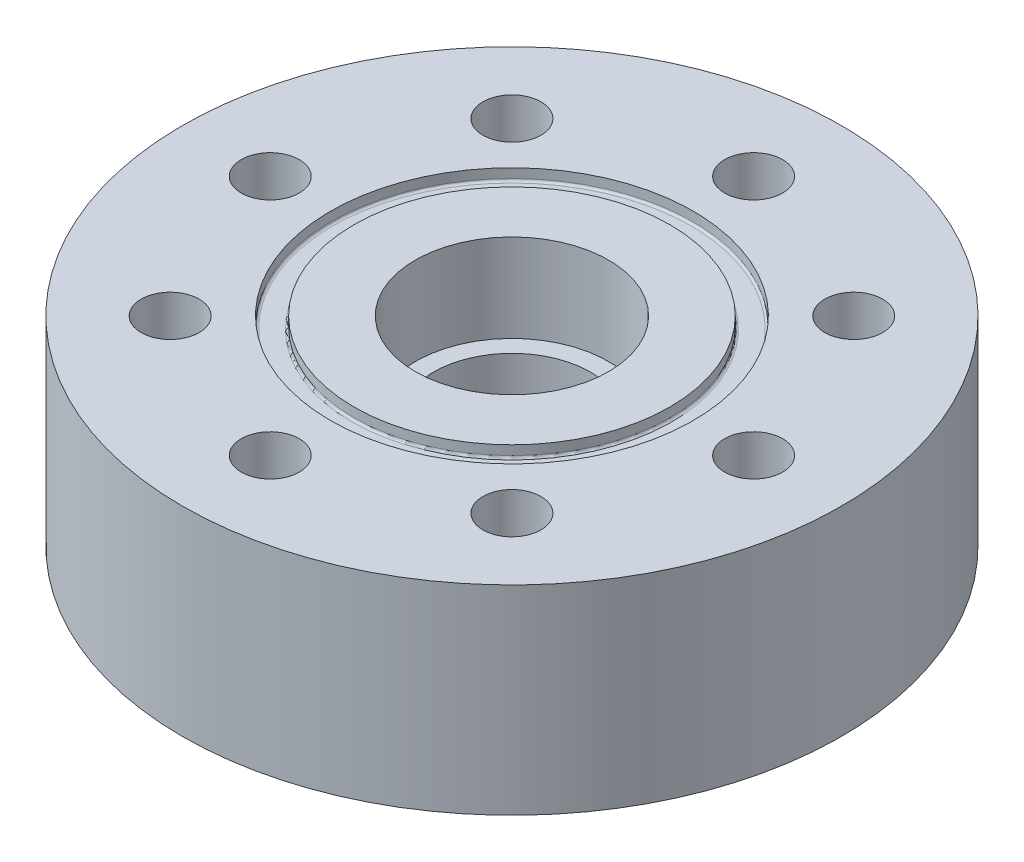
from build123d import *

# Parameters (mm, degrees)
SKETCH2_R                 = 37.5
OUTER_CYLINDER_DEPTH      = 22.7
SKETCH3_R                 = 8.93
NPT_HOLE_DEPTH            = 12.7
SKETCH4_R                 = 3.3
BOLT_HOLES_DEPTH          = 58.687000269
SKETCH5_R                 = 20.6375
SKETCH5_R_2               = 17.9705
O_RING_GROOVE_DEPTH       = 1.3208
FILLET1_R                 = 0.254
SKETCH6_R                 = 11
INLET_FLOW_DIAMETER_DEPTH = 10


with BuildPart() as part:
    # Sketch2 → Outer Cylinder (new body)
    with BuildSketch(Plane(origin=(0, 0, 0), x_dir=(1, 0, 0), z_dir=(0, 1, 0))):
        with Locations(Location((0, 0, 0), (0, 0, 270))):
            Circle(SKETCH2_R)
    extrude(amount=OUTER_CYLINDER_DEPTH)

    # Sketch3 → NPT Hole (cut)
    with BuildSketch(Plane.XZ):
        with Locations(Location((0, 0, 0), (0, 0, 270))):
            Circle(SKETCH3_R)
    extrude(amount=-NPT_HOLE_DEPTH, mode=Mode.SUBTRACT)

    # Sketch4 → Bolt Holes (cut, through all)
    with BuildSketch(Plane.XZ):
        with Locations(Location((-27.5, 0, 0), (0, 0, 270))):
            Circle(SKETCH4_R)
        with Locations(Location((-19.445436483, 19.445436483, 0), (0, 0, 270))):
            Circle(SKETCH4_R)
        with Locations(Location((0, 27.5, 0), (0, 0, 270))):
            Circle(SKETCH4_R)
        with Locations(Location((19.445436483, 19.445436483, 0), (0, 0, 270))):
            Circle(SKETCH4_R)
        with Locations(Location((27.5, 0, 0), (0, 0, 270))):
            Circle(SKETCH4_R)
        with Locations(Location((19.445436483, -19.445436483, 0), (0, 0, 270))):
            Circle(SKETCH4_R)
        with Locations(Location((0, -27.5, 0), (0, 0, 270))):
            Circle(SKETCH4_R)
        with Locations(Location((-19.445436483, -19.445436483, 0), (0, 0, 270))):
            Circle(SKETCH4_R)
    extrude(amount=-BOLT_HOLES_DEPTH, mode=Mode.SUBTRACT)

    # Sketch5 → O-Ring Groove (cut)
    with BuildSketch(Plane(origin=(0, 22.7, 0), x_dir=(1, 0, 0), z_dir=(0, 1, 0))):
        with Locations(Location((0, 0, 0), (0, 0, 270))):
            Circle(SKETCH5_R)
        with Locations(Location((0, 0, 0), (0, 0, 270))):
            Circle(SKETCH5_R_2, mode=Mode.SUBTRACT)
    extrude(amount=-O_RING_GROOVE_DEPTH, mode=Mode.SUBTRACT)

    # Fillet1
    fillet1_edges = [part.edges().sort_by_distance(p)[0] for p in [
        (0, 21.3792, -20.6375),
        (0, 21.3792, -17.9705),
    ]]
    fillet(fillet1_edges, radius=FILLET1_R)

    # Sketch6 → Inlet Flow Diameter (cut)
    with BuildSketch(Plane(origin=(0, 22.7, 0), x_dir=(1, 0, 0), z_dir=(0, 1, 0))):
        with Locations(Location((0, 0, 0), (0, 0, 270))):
            Circle(SKETCH6_R)
    extrude(amount=-INLET_FLOW_DIAMETER_DEPTH, mode=Mode.SUBTRACT)


solid = part.part
